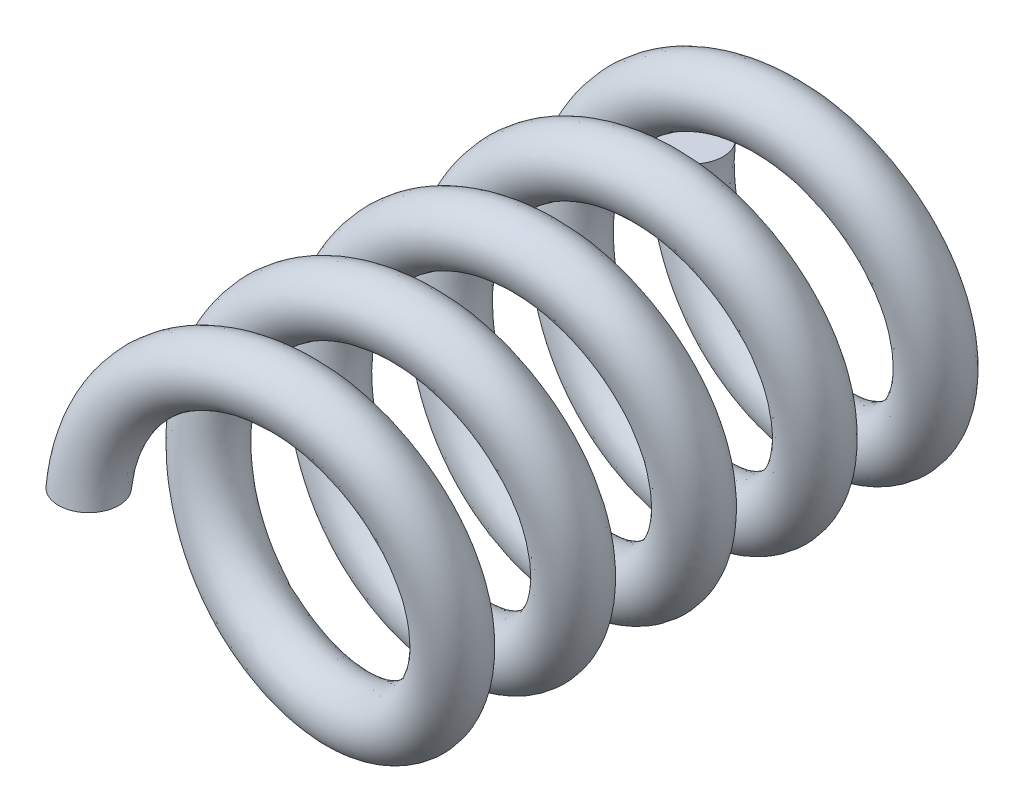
ISO-10303-21;
HEADER;
FILE_DESCRIPTION(('STEP AP214'),'2;1');
FILE_NAME('part.step','',(''),(''),'','','');
FILE_SCHEMA(('AUTOMOTIVE_DESIGN { 1 0 10303 214 1 1 1 1 }'));
ENDSEC;
DATA;
#1=APPLICATION_CONTEXT('core data for automotive mechanical design processes');
#2=APPLICATION_PROTOCOL_DEFINITION('international standard','automotive_design',2000,#1);
#3=PRODUCT_CONTEXT('',#1,'mechanical');
#4=PRODUCT('Part','Part','',(#3));
#5=PRODUCT_RELATED_PRODUCT_CATEGORY('part','',(#4));
#6=PRODUCT_DEFINITION_FORMATION('','',#4);
#7=PRODUCT_DEFINITION_CONTEXT('part definition',#1,'design');
#8=PRODUCT_DEFINITION('design','',#6,#7);
#9=PRODUCT_DEFINITION_SHAPE('','',#8);
#10=(LENGTH_UNIT() NAMED_UNIT(*) SI_UNIT(.MILLI.,.METRE.));
#11=(NAMED_UNIT(*) PLANE_ANGLE_UNIT() SI_UNIT($,.RADIAN.));
#12=(NAMED_UNIT(*) SI_UNIT($,.STERADIAN.) SOLID_ANGLE_UNIT());
#13=UNCERTAINTY_MEASURE_WITH_UNIT(LENGTH_MEASURE(1.E-05),#10,'distance_accuracy_value','');
#14=(GEOMETRIC_REPRESENTATION_CONTEXT(3) GLOBAL_UNCERTAINTY_ASSIGNED_CONTEXT((#13)) GLOBAL_UNIT_ASSIGNED_CONTEXT((#10,
#11,#12)) REPRESENTATION_CONTEXT('',''));
#15=CARTESIAN_POINT('',(0.,0.,0.));
#16=DIRECTION('',(0.,0.,1.));
#17=DIRECTION('',(1.,0.,0.));
#18=AXIS2_PLACEMENT_3D('',#15,#16,#17);
#19=CARTESIAN_POINT('',(0.,0.,0.));
#20=DIRECTION('',(0.,1.,0.));
#21=DIRECTION('',(0.,0.,1.));
#22=AXIS2_PLACEMENT_3D('',#19,#20,#21);
#23=PLANE('',#22);
#24=CARTESIAN_POINT('',(0.,0.,0.));
#25=DIRECTION('',(0.,1.,0.));
#26=DIRECTION('',(0.,0.,1.));
#27=AXIS2_PLACEMENT_3D('',#24,#25,#26);
#28=CIRCLE('',#27,0.254);
#29=CARTESIAN_POINT('',(0.,0.,0.254));
#30=VERTEX_POINT('',#29);
#31=EDGE_CURVE('E40',#30,#30,#28,.T.);
#32=ORIENTED_EDGE('',*,*,#31,.F.);
#33=EDGE_LOOP('',(#32));
#34=FACE_BOUND('',#33,.T.);
#35=ADVANCED_FACE('F33',(#34),#23,.F.);
#36=CARTESIAN_POINT('',(0.,1.02219465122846E-13,-5.08));
#37=DIRECTION('',(0.,1.,0.));
#38=DIRECTION('',(0.,0.,1.));
#39=AXIS2_PLACEMENT_3D('',#36,#37,#38);
#40=PLANE('',#39);
#41=CARTESIAN_POINT('',(0.,1.02219465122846E-13,-5.08));
#42=DIRECTION('',(0.,1.,0.));
#43=DIRECTION('',(0.,0.,1.));
#44=AXIS2_PLACEMENT_3D('',#41,#42,#43);
#45=CIRCLE('',#44,0.254);
#46=CARTESIAN_POINT('',(0.,1.02219465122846E-13,-4.826));
#47=VERTEX_POINT('',#46);
#48=EDGE_CURVE('E11',#47,#47,#45,.T.);
#49=ORIENTED_EDGE('',*,*,#48,.T.);
#50=EDGE_LOOP('',(#49));
#51=FACE_BOUND('',#50,.T.);
#52=ADVANCED_FACE('F47',(#51),#40,.T.);
#53=CARTESIAN_POINT('',(0.,0.,0.254));
#54=CARTESIAN_POINT('',(0.,0.733234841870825,0.169333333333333));
#55=CARTESIAN_POINT('',(0.635,1.09985226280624,0.084666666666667));
#56=CARTESIAN_POINT('',(1.27,1.46646968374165,0.));
#57=CARTESIAN_POINT('',(1.905,1.09985226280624,-0.0846666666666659));
#58=CARTESIAN_POINT('',(2.54,0.733234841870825,-0.169333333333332));
#59=CARTESIAN_POINT('',(2.54,0.,-0.253999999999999));
#60=CARTESIAN_POINT('',(2.54,-0.733234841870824,-0.338666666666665));
#61=CARTESIAN_POINT('',(1.905,-1.09985226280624,-0.423333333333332));
#62=CARTESIAN_POINT('',(1.27,-1.46646968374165,-0.507999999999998));
#63=CARTESIAN_POINT('',(0.635000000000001,-1.09985226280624,-0.592666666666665));
#64=CARTESIAN_POINT('',(0.,-0.733234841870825,-0.677333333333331));
#65=CARTESIAN_POINT('',(0.,0.,-0.761999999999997));
#66=CARTESIAN_POINT('',(0.,0.733234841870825,-0.846666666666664));
#67=CARTESIAN_POINT('',(0.635,1.09985226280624,-0.93133333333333));
#68=CARTESIAN_POINT('',(1.27,1.46646968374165,-1.016));
#69=CARTESIAN_POINT('',(1.905,1.09985226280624,-1.10066666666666));
#70=CARTESIAN_POINT('',(2.54,0.733234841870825,-1.18533333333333));
#71=CARTESIAN_POINT('',(2.54,0.,-1.27));
#72=CARTESIAN_POINT('',(2.54,-0.733234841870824,-1.35466666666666));
#73=CARTESIAN_POINT('',(1.905,-1.09985226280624,-1.43933333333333));
#74=CARTESIAN_POINT('',(1.27,-1.46646968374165,-1.524));
#75=CARTESIAN_POINT('',(0.635000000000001,-1.09985226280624,-1.60866666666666));
#76=CARTESIAN_POINT('',(0.,-0.733234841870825,-1.69333333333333));
#77=CARTESIAN_POINT('',(0.,0.,-1.77799999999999));
#78=CARTESIAN_POINT('',(0.,0.733234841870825,-1.86266666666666));
#79=CARTESIAN_POINT('',(0.635,1.09985226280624,-1.94733333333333));
#80=CARTESIAN_POINT('',(1.27,1.46646968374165,-2.03199999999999));
#81=CARTESIAN_POINT('',(1.905,1.09985226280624,-2.11666666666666));
#82=CARTESIAN_POINT('',(2.54,0.733234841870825,-2.20133333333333));
#83=CARTESIAN_POINT('',(2.54,0.,-2.28599999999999));
#84=CARTESIAN_POINT('',(2.54,-0.733234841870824,-2.37066666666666));
#85=CARTESIAN_POINT('',(1.905,-1.09985226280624,-2.45533333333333));
#86=CARTESIAN_POINT('',(1.27,-1.46646968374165,-2.53999999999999));
#87=CARTESIAN_POINT('',(0.635000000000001,-1.09985226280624,-2.62466666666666));
#88=CARTESIAN_POINT('',(0.,-0.733234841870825,-2.70933333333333));
#89=CARTESIAN_POINT('',(0.,0.,-2.79399999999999));
#90=CARTESIAN_POINT('',(0.,0.733234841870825,-2.87866666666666));
#91=CARTESIAN_POINT('',(0.635,1.09985226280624,-2.96333333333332));
#92=CARTESIAN_POINT('',(1.27,1.46646968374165,-3.04799999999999));
#93=CARTESIAN_POINT('',(1.905,1.09985226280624,-3.13266666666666));
#94=CARTESIAN_POINT('',(2.54,0.733234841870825,-3.21733333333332));
#95=CARTESIAN_POINT('',(2.54,0.,-3.30199999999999));
#96=CARTESIAN_POINT('',(2.54,-0.733234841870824,-3.38666666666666));
#97=CARTESIAN_POINT('',(1.905,-1.09985226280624,-3.47133333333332));
#98=CARTESIAN_POINT('',(1.27,-1.46646968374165,-3.55599999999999));
#99=CARTESIAN_POINT('',(0.635000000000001,-1.09985226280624,-3.64066666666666));
#100=CARTESIAN_POINT('',(0.,-0.733234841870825,-3.72533333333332));
#101=CARTESIAN_POINT('',(0.,0.,-3.80999999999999));
#102=CARTESIAN_POINT('',(0.,0.733234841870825,-3.89466666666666));
#103=CARTESIAN_POINT('',(0.635,1.09985226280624,-3.97933333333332));
#104=CARTESIAN_POINT('',(1.27,1.46646968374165,-4.06399999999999));
#105=CARTESIAN_POINT('',(1.905,1.09985226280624,-4.14866666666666));
#106=CARTESIAN_POINT('',(2.54,0.733234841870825,-4.23333333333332));
#107=CARTESIAN_POINT('',(2.54,0.,-4.31799999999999));
#108=CARTESIAN_POINT('',(2.54,-0.733234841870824,-4.40266666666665));
#109=CARTESIAN_POINT('',(1.905,-1.09985226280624,-4.48733333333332));
#110=CARTESIAN_POINT('',(1.27,-1.46646968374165,-4.57199999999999));
#111=CARTESIAN_POINT('',(0.635000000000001,-1.09985226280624,-4.65666666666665));
#112=CARTESIAN_POINT('',(0.,-0.733234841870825,-4.74133333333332));
#113=CARTESIAN_POINT('',(0.,0.,-4.82599999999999));
#114=CARTESIAN_POINT('',(0.508,0.,0.254));
#115=CARTESIAN_POINT('',(0.508,0.439940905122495,0.169333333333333));
#116=CARTESIAN_POINT('',(0.889,0.659911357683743,0.084666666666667));
#117=CARTESIAN_POINT('',(1.27,0.87988181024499,0.));
#118=CARTESIAN_POINT('',(1.651,0.659911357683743,-0.0846666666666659));
#119=CARTESIAN_POINT('',(2.032,0.439940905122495,-0.169333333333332));
#120=CARTESIAN_POINT('',(2.032,0.,-0.253999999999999));
#121=CARTESIAN_POINT('',(2.032,-0.439940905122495,-0.338666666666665));
#122=CARTESIAN_POINT('',(1.651,-0.659911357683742,-0.423333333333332));
#123=CARTESIAN_POINT('',(1.27,-0.87988181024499,-0.507999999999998));
#124=CARTESIAN_POINT('',(0.889,-0.659911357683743,-0.592666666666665));
#125=CARTESIAN_POINT('',(0.508,-0.439940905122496,-0.677333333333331));
#126=CARTESIAN_POINT('',(0.508,0.,-0.761999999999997));
#127=CARTESIAN_POINT('',(0.508,0.439940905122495,-0.846666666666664));
#128=CARTESIAN_POINT('',(0.889,0.659911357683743,-0.93133333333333));
#129=CARTESIAN_POINT('',(1.27,0.87988181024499,-1.016));
#130=CARTESIAN_POINT('',(1.651,0.659911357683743,-1.10066666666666));
#131=CARTESIAN_POINT('',(2.032,0.439940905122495,-1.18533333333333));
#132=CARTESIAN_POINT('',(2.032,0.,-1.27));
#133=CARTESIAN_POINT('',(2.032,-0.439940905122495,-1.35466666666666));
#134=CARTESIAN_POINT('',(1.651,-0.659911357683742,-1.43933333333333));
#135=CARTESIAN_POINT('',(1.27,-0.87988181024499,-1.524));
#136=CARTESIAN_POINT('',(0.889,-0.659911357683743,-1.60866666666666));
#137=CARTESIAN_POINT('',(0.508,-0.439940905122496,-1.69333333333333));
#138=CARTESIAN_POINT('',(0.508,0.,-1.778));
#139=CARTESIAN_POINT('',(0.508,0.439940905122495,-1.86266666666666));
#140=CARTESIAN_POINT('',(0.889,0.659911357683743,-1.94733333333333));
#141=CARTESIAN_POINT('',(1.27,0.87988181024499,-2.03199999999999));
#142=CARTESIAN_POINT('',(1.651,0.659911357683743,-2.11666666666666));
#143=CARTESIAN_POINT('',(2.032,0.439940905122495,-2.20133333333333));
#144=CARTESIAN_POINT('',(2.032,0.,-2.28599999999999));
#145=CARTESIAN_POINT('',(2.032,-0.439940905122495,-2.37066666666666));
#146=CARTESIAN_POINT('',(1.651,-0.659911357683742,-2.45533333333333));
#147=CARTESIAN_POINT('',(1.27,-0.87988181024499,-2.53999999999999));
#148=CARTESIAN_POINT('',(0.889,-0.659911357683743,-2.62466666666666));
#149=CARTESIAN_POINT('',(0.508,-0.439940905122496,-2.70933333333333));
#150=CARTESIAN_POINT('',(0.508,0.,-2.79399999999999));
#151=CARTESIAN_POINT('',(0.508,0.439940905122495,-2.87866666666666));
#152=CARTESIAN_POINT('',(0.889,0.659911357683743,-2.96333333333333));
#153=CARTESIAN_POINT('',(1.27,0.87988181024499,-3.04799999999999));
#154=CARTESIAN_POINT('',(1.651,0.659911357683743,-3.13266666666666));
#155=CARTESIAN_POINT('',(2.032,0.439940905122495,-3.21733333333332));
#156=CARTESIAN_POINT('',(2.032,0.,-3.30199999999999));
#157=CARTESIAN_POINT('',(2.032,-0.439940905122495,-3.38666666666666));
#158=CARTESIAN_POINT('',(1.651,-0.659911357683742,-3.47133333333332));
#159=CARTESIAN_POINT('',(1.27,-0.87988181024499,-3.55599999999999));
#160=CARTESIAN_POINT('',(0.889,-0.659911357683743,-3.64066666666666));
#161=CARTESIAN_POINT('',(0.508,-0.439940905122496,-3.72533333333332));
#162=CARTESIAN_POINT('',(0.508,0.,-3.80999999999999));
#163=CARTESIAN_POINT('',(0.508,0.439940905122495,-3.89466666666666));
#164=CARTESIAN_POINT('',(0.889,0.659911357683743,-3.97933333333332));
#165=CARTESIAN_POINT('',(1.27,0.87988181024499,-4.06399999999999));
#166=CARTESIAN_POINT('',(1.651,0.659911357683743,-4.14866666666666));
#167=CARTESIAN_POINT('',(2.032,0.439940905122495,-4.23333333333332));
#168=CARTESIAN_POINT('',(2.032,0.,-4.31799999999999));
#169=CARTESIAN_POINT('',(2.032,-0.439940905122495,-4.40266666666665));
#170=CARTESIAN_POINT('',(1.651,-0.659911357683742,-4.48733333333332));
#171=CARTESIAN_POINT('',(1.27,-0.87988181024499,-4.57199999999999));
#172=CARTESIAN_POINT('',(0.889,-0.659911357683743,-4.65666666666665));
#173=CARTESIAN_POINT('',(0.508,-0.439940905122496,-4.74133333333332));
#174=CARTESIAN_POINT('',(0.508,0.,-4.82599999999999));
#175=CARTESIAN_POINT('',(0.508,0.,-0.254));
#176=CARTESIAN_POINT('',(0.508,0.439940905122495,-0.338666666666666));
#177=CARTESIAN_POINT('',(0.889,0.659911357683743,-0.423333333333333));
#178=CARTESIAN_POINT('',(1.27,0.87988181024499,-0.507999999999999));
#179=CARTESIAN_POINT('',(1.651,0.659911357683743,-0.592666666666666));
#180=CARTESIAN_POINT('',(2.032,0.439940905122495,-0.677333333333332));
#181=CARTESIAN_POINT('',(2.032,0.,-0.761999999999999));
#182=CARTESIAN_POINT('',(2.032,-0.439940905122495,-0.846666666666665));
#183=CARTESIAN_POINT('',(1.651,-0.659911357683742,-0.931333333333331));
#184=CARTESIAN_POINT('',(1.27,-0.87988181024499,-1.016));
#185=CARTESIAN_POINT('',(0.889,-0.659911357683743,-1.10066666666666));
#186=CARTESIAN_POINT('',(0.508,-0.439940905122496,-1.18533333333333));
#187=CARTESIAN_POINT('',(0.508,0.,-1.27));
#188=CARTESIAN_POINT('',(0.508,0.439940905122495,-1.35466666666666));
#189=CARTESIAN_POINT('',(0.889,0.659911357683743,-1.43933333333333));
#190=CARTESIAN_POINT('',(1.27,0.87988181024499,-1.524));
#191=CARTESIAN_POINT('',(1.651,0.659911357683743,-1.60866666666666));
#192=CARTESIAN_POINT('',(2.032,0.439940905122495,-1.69333333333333));
#193=CARTESIAN_POINT('',(2.032,0.,-1.778));
#194=CARTESIAN_POINT('',(2.032,-0.439940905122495,-1.86266666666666));
#195=CARTESIAN_POINT('',(1.651,-0.659911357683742,-1.94733333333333));
#196=CARTESIAN_POINT('',(1.27,-0.87988181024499,-2.032));
#197=CARTESIAN_POINT('',(0.889,-0.659911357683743,-2.11666666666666));
#198=CARTESIAN_POINT('',(0.508,-0.439940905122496,-2.20133333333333));
#199=CARTESIAN_POINT('',(0.508,0.,-2.28599999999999));
#200=CARTESIAN_POINT('',(0.508,0.439940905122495,-2.37066666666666));
#201=CARTESIAN_POINT('',(0.889,0.659911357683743,-2.45533333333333));
#202=CARTESIAN_POINT('',(1.27,0.87988181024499,-2.53999999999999));
#203=CARTESIAN_POINT('',(1.651,0.659911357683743,-2.62466666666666));
#204=CARTESIAN_POINT('',(2.032,0.439940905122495,-2.70933333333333));
#205=CARTESIAN_POINT('',(2.032,0.,-2.79399999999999));
#206=CARTESIAN_POINT('',(2.032,-0.439940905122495,-2.87866666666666));
#207=CARTESIAN_POINT('',(1.651,-0.659911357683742,-2.96333333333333));
#208=CARTESIAN_POINT('',(1.27,-0.87988181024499,-3.04799999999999));
#209=CARTESIAN_POINT('',(0.889,-0.659911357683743,-3.13266666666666));
#210=CARTESIAN_POINT('',(0.508,-0.439940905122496,-3.21733333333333));
#211=CARTESIAN_POINT('',(0.508,0.,-3.30199999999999));
#212=CARTESIAN_POINT('',(0.508,0.439940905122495,-3.38666666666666));
#213=CARTESIAN_POINT('',(0.889,0.659911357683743,-3.47133333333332));
#214=CARTESIAN_POINT('',(1.27,0.87988181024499,-3.55599999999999));
#215=CARTESIAN_POINT('',(1.651,0.659911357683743,-3.64066666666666));
#216=CARTESIAN_POINT('',(2.032,0.439940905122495,-3.72533333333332));
#217=CARTESIAN_POINT('',(2.032,0.,-3.80999999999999));
#218=CARTESIAN_POINT('',(2.032,-0.439940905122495,-3.89466666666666));
#219=CARTESIAN_POINT('',(1.651,-0.659911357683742,-3.97933333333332));
#220=CARTESIAN_POINT('',(1.27,-0.87988181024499,-4.06399999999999));
#221=CARTESIAN_POINT('',(0.889,-0.659911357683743,-4.14866666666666));
#222=CARTESIAN_POINT('',(0.508,-0.439940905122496,-4.23333333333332));
#223=CARTESIAN_POINT('',(0.508,0.,-4.31799999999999));
#224=CARTESIAN_POINT('',(0.508,0.439940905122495,-4.40266666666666));
#225=CARTESIAN_POINT('',(0.889,0.659911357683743,-4.48733333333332));
#226=CARTESIAN_POINT('',(1.27,0.87988181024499,-4.57199999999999));
#227=CARTESIAN_POINT('',(1.651,0.659911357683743,-4.65666666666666));
#228=CARTESIAN_POINT('',(2.032,0.439940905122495,-4.74133333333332));
#229=CARTESIAN_POINT('',(2.032,0.,-4.82599999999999));
#230=CARTESIAN_POINT('',(2.032,-0.439940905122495,-4.91066666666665));
#231=CARTESIAN_POINT('',(1.651,-0.659911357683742,-4.99533333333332));
#232=CARTESIAN_POINT('',(1.27,-0.87988181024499,-5.07999999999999));
#233=CARTESIAN_POINT('',(0.889,-0.659911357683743,-5.16466666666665));
#234=CARTESIAN_POINT('',(0.508,-0.439940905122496,-5.24933333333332));
#235=CARTESIAN_POINT('',(0.508,0.,-5.33399999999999));
#236=CARTESIAN_POINT('',(0.,0.,-0.254));
#237=CARTESIAN_POINT('',(0.,0.733234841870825,-0.338666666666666));
#238=CARTESIAN_POINT('',(0.635,1.09985226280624,-0.423333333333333));
#239=CARTESIAN_POINT('',(1.27,1.46646968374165,-0.507999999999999));
#240=CARTESIAN_POINT('',(1.905,1.09985226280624,-0.592666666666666));
#241=CARTESIAN_POINT('',(2.54,0.733234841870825,-0.677333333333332));
#242=CARTESIAN_POINT('',(2.54,0.,-0.761999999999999));
#243=CARTESIAN_POINT('',(2.54,-0.733234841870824,-0.846666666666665));
#244=CARTESIAN_POINT('',(1.905,-1.09985226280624,-0.931333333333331));
#245=CARTESIAN_POINT('',(1.27,-1.46646968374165,-1.016));
#246=CARTESIAN_POINT('',(0.635000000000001,-1.09985226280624,-1.10066666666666));
#247=CARTESIAN_POINT('',(0.,-0.733234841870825,-1.18533333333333));
#248=CARTESIAN_POINT('',(0.,0.,-1.27));
#249=CARTESIAN_POINT('',(0.,0.733234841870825,-1.35466666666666));
#250=CARTESIAN_POINT('',(0.635,1.09985226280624,-1.43933333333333));
#251=CARTESIAN_POINT('',(1.27,1.46646968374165,-1.524));
#252=CARTESIAN_POINT('',(1.905,1.09985226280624,-1.60866666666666));
#253=CARTESIAN_POINT('',(2.54,0.733234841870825,-1.69333333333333));
#254=CARTESIAN_POINT('',(2.54,0.,-1.778));
#255=CARTESIAN_POINT('',(2.54,-0.733234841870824,-1.86266666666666));
#256=CARTESIAN_POINT('',(1.905,-1.09985226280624,-1.94733333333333));
#257=CARTESIAN_POINT('',(1.27,-1.46646968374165,-2.032));
#258=CARTESIAN_POINT('',(0.635000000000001,-1.09985226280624,-2.11666666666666));
#259=CARTESIAN_POINT('',(0.,-0.733234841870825,-2.20133333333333));
#260=CARTESIAN_POINT('',(0.,0.,-2.28599999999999));
#261=CARTESIAN_POINT('',(0.,0.733234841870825,-2.37066666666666));
#262=CARTESIAN_POINT('',(0.635,1.09985226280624,-2.45533333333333));
#263=CARTESIAN_POINT('',(1.27,1.46646968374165,-2.53999999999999));
#264=CARTESIAN_POINT('',(1.905,1.09985226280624,-2.62466666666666));
#265=CARTESIAN_POINT('',(2.54,0.733234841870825,-2.70933333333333));
#266=CARTESIAN_POINT('',(2.54,0.,-2.79399999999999));
#267=CARTESIAN_POINT('',(2.54,-0.733234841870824,-2.87866666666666));
#268=CARTESIAN_POINT('',(1.905,-1.09985226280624,-2.96333333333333));
#269=CARTESIAN_POINT('',(1.27,-1.46646968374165,-3.04799999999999));
#270=CARTESIAN_POINT('',(0.635000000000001,-1.09985226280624,-3.13266666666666));
#271=CARTESIAN_POINT('',(0.,-0.733234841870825,-3.21733333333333));
#272=CARTESIAN_POINT('',(0.,0.,-3.30199999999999));
#273=CARTESIAN_POINT('',(0.,0.733234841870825,-3.38666666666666));
#274=CARTESIAN_POINT('',(0.635,1.09985226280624,-3.47133333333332));
#275=CARTESIAN_POINT('',(1.27,1.46646968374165,-3.55599999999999));
#276=CARTESIAN_POINT('',(1.905,1.09985226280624,-3.64066666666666));
#277=CARTESIAN_POINT('',(2.54,0.733234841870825,-3.72533333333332));
#278=CARTESIAN_POINT('',(2.54,0.,-3.80999999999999));
#279=CARTESIAN_POINT('',(2.54,-0.733234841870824,-3.89466666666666));
#280=CARTESIAN_POINT('',(1.905,-1.09985226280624,-3.97933333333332));
#281=CARTESIAN_POINT('',(1.27,-1.46646968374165,-4.06399999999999));
#282=CARTESIAN_POINT('',(0.635000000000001,-1.09985226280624,-4.14866666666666));
#283=CARTESIAN_POINT('',(0.,-0.733234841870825,-4.23333333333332));
#284=CARTESIAN_POINT('',(0.,0.,-4.31799999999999));
#285=CARTESIAN_POINT('',(0.,0.733234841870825,-4.40266666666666));
#286=CARTESIAN_POINT('',(0.635,1.09985226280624,-4.48733333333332));
#287=CARTESIAN_POINT('',(1.27,1.46646968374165,-4.57199999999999));
#288=CARTESIAN_POINT('',(1.905,1.09985226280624,-4.65666666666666));
#289=CARTESIAN_POINT('',(2.54,0.733234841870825,-4.74133333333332));
#290=CARTESIAN_POINT('',(2.54,0.,-4.82599999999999));
#291=CARTESIAN_POINT('',(2.54,-0.733234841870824,-4.91066666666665));
#292=CARTESIAN_POINT('',(1.905,-1.09985226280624,-4.99533333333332));
#293=CARTESIAN_POINT('',(1.27,-1.46646968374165,-5.07999999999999));
#294=CARTESIAN_POINT('',(0.635000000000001,-1.09985226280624,-5.16466666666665));
#295=CARTESIAN_POINT('',(0.,-0.733234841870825,-5.24933333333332));
#296=CARTESIAN_POINT('',(0.,0.,-5.33399999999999));
#297=CARTESIAN_POINT('',(-0.508,0.,-0.254));
#298=CARTESIAN_POINT('',(-0.508,1.02652877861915,-0.338666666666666));
#299=CARTESIAN_POINT('',(0.381,1.53979316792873,-0.423333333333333));
#300=CARTESIAN_POINT('',(1.27,2.05305755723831,-0.507999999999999));
#301=CARTESIAN_POINT('',(2.159,1.53979316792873,-0.592666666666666));
#302=CARTESIAN_POINT('',(3.048,1.02652877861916,-0.677333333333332));
#303=CARTESIAN_POINT('',(3.048,0.,-0.761999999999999));
#304=CARTESIAN_POINT('',(3.048,-1.02652877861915,-0.846666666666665));
#305=CARTESIAN_POINT('',(2.159,-1.53979316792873,-0.931333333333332));
#306=CARTESIAN_POINT('',(1.27,-2.05305755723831,-1.016));
#307=CARTESIAN_POINT('',(0.381000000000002,-1.53979316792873,-1.10066666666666));
#308=CARTESIAN_POINT('',(-0.507999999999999,-1.02652877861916,-1.18533333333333));
#309=CARTESIAN_POINT('',(-0.508,0.,-1.27));
#310=CARTESIAN_POINT('',(-0.508,1.02652877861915,-1.35466666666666));
#311=CARTESIAN_POINT('',(0.381,1.53979316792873,-1.43933333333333));
#312=CARTESIAN_POINT('',(1.27,2.05305755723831,-1.524));
#313=CARTESIAN_POINT('',(2.159,1.53979316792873,-1.60866666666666));
#314=CARTESIAN_POINT('',(3.048,1.02652877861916,-1.69333333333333));
#315=CARTESIAN_POINT('',(3.048,0.,-1.778));
#316=CARTESIAN_POINT('',(3.048,-1.02652877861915,-1.86266666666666));
#317=CARTESIAN_POINT('',(2.159,-1.53979316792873,-1.94733333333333));
#318=CARTESIAN_POINT('',(1.27,-2.05305755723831,-2.032));
#319=CARTESIAN_POINT('',(0.381000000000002,-1.53979316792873,-2.11666666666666));
#320=CARTESIAN_POINT('',(-0.507999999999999,-1.02652877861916,-2.20133333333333));
#321=CARTESIAN_POINT('',(-0.508,0.,-2.28599999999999));
#322=CARTESIAN_POINT('',(-0.508,1.02652877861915,-2.37066666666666));
#323=CARTESIAN_POINT('',(0.381,1.53979316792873,-2.45533333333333));
#324=CARTESIAN_POINT('',(1.27,2.05305755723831,-2.53999999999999));
#325=CARTESIAN_POINT('',(2.159,1.53979316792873,-2.62466666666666));
#326=CARTESIAN_POINT('',(3.048,1.02652877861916,-2.70933333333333));
#327=CARTESIAN_POINT('',(3.048,0.,-2.79399999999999));
#328=CARTESIAN_POINT('',(3.048,-1.02652877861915,-2.87866666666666));
#329=CARTESIAN_POINT('',(2.159,-1.53979316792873,-2.96333333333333));
#330=CARTESIAN_POINT('',(1.27,-2.05305755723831,-3.04799999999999));
#331=CARTESIAN_POINT('',(0.381000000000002,-1.53979316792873,-3.13266666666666));
#332=CARTESIAN_POINT('',(-0.507999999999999,-1.02652877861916,-3.21733333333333));
#333=CARTESIAN_POINT('',(-0.508,0.,-3.30199999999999));
#334=CARTESIAN_POINT('',(-0.508,1.02652877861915,-3.38666666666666));
#335=CARTESIAN_POINT('',(0.381,1.53979316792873,-3.47133333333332));
#336=CARTESIAN_POINT('',(1.27,2.05305755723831,-3.55599999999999));
#337=CARTESIAN_POINT('',(2.159,1.53979316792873,-3.64066666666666));
#338=CARTESIAN_POINT('',(3.048,1.02652877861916,-3.72533333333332));
#339=CARTESIAN_POINT('',(3.048,0.,-3.80999999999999));
#340=CARTESIAN_POINT('',(3.048,-1.02652877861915,-3.89466666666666));
#341=CARTESIAN_POINT('',(2.159,-1.53979316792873,-3.97933333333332));
#342=CARTESIAN_POINT('',(1.27,-2.05305755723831,-4.06399999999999));
#343=CARTESIAN_POINT('',(0.381000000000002,-1.53979316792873,-4.14866666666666));
#344=CARTESIAN_POINT('',(-0.507999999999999,-1.02652877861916,-4.23333333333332));
#345=CARTESIAN_POINT('',(-0.508,0.,-4.31799999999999));
#346=CARTESIAN_POINT('',(-0.508,1.02652877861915,-4.40266666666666));
#347=CARTESIAN_POINT('',(0.381,1.53979316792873,-4.48733333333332));
#348=CARTESIAN_POINT('',(1.27,2.05305755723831,-4.57199999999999));
#349=CARTESIAN_POINT('',(2.159,1.53979316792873,-4.65666666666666));
#350=CARTESIAN_POINT('',(3.048,1.02652877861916,-4.74133333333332));
#351=CARTESIAN_POINT('',(3.048,0.,-4.82599999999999));
#352=CARTESIAN_POINT('',(3.048,-1.02652877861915,-4.91066666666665));
#353=CARTESIAN_POINT('',(2.159,-1.53979316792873,-4.99533333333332));
#354=CARTESIAN_POINT('',(1.27,-2.05305755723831,-5.07999999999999));
#355=CARTESIAN_POINT('',(0.381000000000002,-1.53979316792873,-5.16466666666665));
#356=CARTESIAN_POINT('',(-0.507999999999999,-1.02652877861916,-5.24933333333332));
#357=CARTESIAN_POINT('',(-0.508,0.,-5.33399999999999));
#358=CARTESIAN_POINT('',(-0.508,0.,0.254));
#359=CARTESIAN_POINT('',(-0.508,1.02652877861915,0.169333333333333));
#360=CARTESIAN_POINT('',(0.381,1.53979316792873,0.084666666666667));
#361=CARTESIAN_POINT('',(1.27,2.05305755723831,0.));
#362=CARTESIAN_POINT('',(2.159,1.53979316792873,-0.0846666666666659));
#363=CARTESIAN_POINT('',(3.048,1.02652877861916,-0.169333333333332));
#364=CARTESIAN_POINT('',(3.048,0.,-0.253999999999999));
#365=CARTESIAN_POINT('',(3.048,-1.02652877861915,-0.338666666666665));
#366=CARTESIAN_POINT('',(2.159,-1.53979316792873,-0.423333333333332));
#367=CARTESIAN_POINT('',(1.27,-2.05305755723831,-0.507999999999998));
#368=CARTESIAN_POINT('',(0.381000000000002,-1.53979316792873,-0.592666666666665));
#369=CARTESIAN_POINT('',(-0.507999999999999,-1.02652877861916,-0.677333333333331));
#370=CARTESIAN_POINT('',(-0.508,0.,-0.761999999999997));
#371=CARTESIAN_POINT('',(-0.508,1.02652877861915,-0.846666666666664));
#372=CARTESIAN_POINT('',(0.381,1.53979316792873,-0.93133333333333));
#373=CARTESIAN_POINT('',(1.27,2.05305755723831,-1.016));
#374=CARTESIAN_POINT('',(2.159,1.53979316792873,-1.10066666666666));
#375=CARTESIAN_POINT('',(3.048,1.02652877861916,-1.18533333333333));
#376=CARTESIAN_POINT('',(3.048,0.,-1.27));
#377=CARTESIAN_POINT('',(3.048,-1.02652877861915,-1.35466666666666));
#378=CARTESIAN_POINT('',(2.159,-1.53979316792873,-1.43933333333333));
#379=CARTESIAN_POINT('',(1.27,-2.05305755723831,-1.524));
#380=CARTESIAN_POINT('',(0.381000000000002,-1.53979316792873,-1.60866666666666));
#381=CARTESIAN_POINT('',(-0.507999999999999,-1.02652877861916,-1.69333333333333));
#382=CARTESIAN_POINT('',(-0.508,0.,-1.778));
#383=CARTESIAN_POINT('',(-0.508,1.02652877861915,-1.86266666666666));
#384=CARTESIAN_POINT('',(0.381,1.53979316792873,-1.94733333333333));
#385=CARTESIAN_POINT('',(1.27,2.05305755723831,-2.03199999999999));
#386=CARTESIAN_POINT('',(2.159,1.53979316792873,-2.11666666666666));
#387=CARTESIAN_POINT('',(3.048,1.02652877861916,-2.20133333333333));
#388=CARTESIAN_POINT('',(3.048,0.,-2.28599999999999));
#389=CARTESIAN_POINT('',(3.048,-1.02652877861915,-2.37066666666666));
#390=CARTESIAN_POINT('',(2.159,-1.53979316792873,-2.45533333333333));
#391=CARTESIAN_POINT('',(1.27,-2.05305755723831,-2.53999999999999));
#392=CARTESIAN_POINT('',(0.381000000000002,-1.53979316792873,-2.62466666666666));
#393=CARTESIAN_POINT('',(-0.507999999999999,-1.02652877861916,-2.70933333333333));
#394=CARTESIAN_POINT('',(-0.508,0.,-2.79399999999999));
#395=CARTESIAN_POINT('',(-0.508,1.02652877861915,-2.87866666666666));
#396=CARTESIAN_POINT('',(0.381,1.53979316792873,-2.96333333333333));
#397=CARTESIAN_POINT('',(1.27,2.05305755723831,-3.04799999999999));
#398=CARTESIAN_POINT('',(2.159,1.53979316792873,-3.13266666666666));
#399=CARTESIAN_POINT('',(3.048,1.02652877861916,-3.21733333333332));
#400=CARTESIAN_POINT('',(3.048,0.,-3.30199999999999));
#401=CARTESIAN_POINT('',(3.048,-1.02652877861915,-3.38666666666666));
#402=CARTESIAN_POINT('',(2.159,-1.53979316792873,-3.47133333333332));
#403=CARTESIAN_POINT('',(1.27,-2.05305755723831,-3.55599999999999));
#404=CARTESIAN_POINT('',(0.381000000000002,-1.53979316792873,-3.64066666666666));
#405=CARTESIAN_POINT('',(-0.507999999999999,-1.02652877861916,-3.72533333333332));
#406=CARTESIAN_POINT('',(-0.508,0.,-3.80999999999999));
#407=CARTESIAN_POINT('',(-0.508,1.02652877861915,-3.89466666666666));
#408=CARTESIAN_POINT('',(0.381,1.53979316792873,-3.97933333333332));
#409=CARTESIAN_POINT('',(1.27,2.05305755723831,-4.06399999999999));
#410=CARTESIAN_POINT('',(2.159,1.53979316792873,-4.14866666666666));
#411=CARTESIAN_POINT('',(3.048,1.02652877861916,-4.23333333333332));
#412=CARTESIAN_POINT('',(3.048,0.,-4.31799999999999));
#413=CARTESIAN_POINT('',(3.048,-1.02652877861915,-4.40266666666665));
#414=CARTESIAN_POINT('',(2.159,-1.53979316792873,-4.48733333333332));
#415=CARTESIAN_POINT('',(1.27,-2.05305755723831,-4.57199999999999));
#416=CARTESIAN_POINT('',(0.381000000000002,-1.53979316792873,-4.65666666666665));
#417=CARTESIAN_POINT('',(-0.507999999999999,-1.02652877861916,-4.74133333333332));
#418=CARTESIAN_POINT('',(-0.508,0.,-4.82599999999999));
#419=CARTESIAN_POINT('',(0.,0.,0.254));
#420=CARTESIAN_POINT('',(0.,0.733234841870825,0.169333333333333));
#421=CARTESIAN_POINT('',(0.635,1.09985226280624,0.084666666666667));
#422=CARTESIAN_POINT('',(1.27,1.46646968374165,0.));
#423=CARTESIAN_POINT('',(1.905,1.09985226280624,-0.0846666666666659));
#424=CARTESIAN_POINT('',(2.54,0.733234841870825,-0.169333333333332));
#425=CARTESIAN_POINT('',(2.54,0.,-0.253999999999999));
#426=CARTESIAN_POINT('',(2.54,-0.733234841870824,-0.338666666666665));
#427=CARTESIAN_POINT('',(1.905,-1.09985226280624,-0.423333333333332));
#428=CARTESIAN_POINT('',(1.27,-1.46646968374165,-0.507999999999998));
#429=CARTESIAN_POINT('',(0.635000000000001,-1.09985226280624,-0.592666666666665));
#430=CARTESIAN_POINT('',(0.,-0.733234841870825,-0.677333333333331));
#431=CARTESIAN_POINT('',(0.,0.,-0.761999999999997));
#432=CARTESIAN_POINT('',(0.,0.733234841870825,-0.846666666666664));
#433=CARTESIAN_POINT('',(0.635,1.09985226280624,-0.93133333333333));
#434=CARTESIAN_POINT('',(1.27,1.46646968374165,-1.016));
#435=CARTESIAN_POINT('',(1.905,1.09985226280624,-1.10066666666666));
#436=CARTESIAN_POINT('',(2.54,0.733234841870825,-1.18533333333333));
#437=CARTESIAN_POINT('',(2.54,0.,-1.27));
#438=CARTESIAN_POINT('',(2.54,-0.733234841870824,-1.35466666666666));
#439=CARTESIAN_POINT('',(1.905,-1.09985226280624,-1.43933333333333));
#440=CARTESIAN_POINT('',(1.27,-1.46646968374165,-1.524));
#441=CARTESIAN_POINT('',(0.635000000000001,-1.09985226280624,-1.60866666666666));
#442=CARTESIAN_POINT('',(0.,-0.733234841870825,-1.69333333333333));
#443=CARTESIAN_POINT('',(0.,0.,-1.77799999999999));
#444=CARTESIAN_POINT('',(0.,0.733234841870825,-1.86266666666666));
#445=CARTESIAN_POINT('',(0.635,1.09985226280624,-1.94733333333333));
#446=CARTESIAN_POINT('',(1.27,1.46646968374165,-2.03199999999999));
#447=CARTESIAN_POINT('',(1.905,1.09985226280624,-2.11666666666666));
#448=CARTESIAN_POINT('',(2.54,0.733234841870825,-2.20133333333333));
#449=CARTESIAN_POINT('',(2.54,0.,-2.28599999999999));
#450=CARTESIAN_POINT('',(2.54,-0.733234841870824,-2.37066666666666));
#451=CARTESIAN_POINT('',(1.905,-1.09985226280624,-2.45533333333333));
#452=CARTESIAN_POINT('',(1.27,-1.46646968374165,-2.53999999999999));
#453=CARTESIAN_POINT('',(0.635000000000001,-1.09985226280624,-2.62466666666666));
#454=CARTESIAN_POINT('',(0.,-0.733234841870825,-2.70933333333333));
#455=CARTESIAN_POINT('',(0.,0.,-2.79399999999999));
#456=CARTESIAN_POINT('',(0.,0.733234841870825,-2.87866666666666));
#457=CARTESIAN_POINT('',(0.635,1.09985226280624,-2.96333333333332));
#458=CARTESIAN_POINT('',(1.27,1.46646968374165,-3.04799999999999));
#459=CARTESIAN_POINT('',(1.905,1.09985226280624,-3.13266666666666));
#460=CARTESIAN_POINT('',(2.54,0.733234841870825,-3.21733333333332));
#461=CARTESIAN_POINT('',(2.54,0.,-3.30199999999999));
#462=CARTESIAN_POINT('',(2.54,-0.733234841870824,-3.38666666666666));
#463=CARTESIAN_POINT('',(1.905,-1.09985226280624,-3.47133333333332));
#464=CARTESIAN_POINT('',(1.27,-1.46646968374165,-3.55599999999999));
#465=CARTESIAN_POINT('',(0.635000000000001,-1.09985226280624,-3.64066666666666));
#466=CARTESIAN_POINT('',(0.,-0.733234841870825,-3.72533333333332));
#467=CARTESIAN_POINT('',(0.,0.,-3.80999999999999));
#468=CARTESIAN_POINT('',(0.,0.733234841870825,-3.89466666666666));
#469=CARTESIAN_POINT('',(0.635,1.09985226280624,-3.97933333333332));
#470=CARTESIAN_POINT('',(1.27,1.46646968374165,-4.06399999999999));
#471=CARTESIAN_POINT('',(1.905,1.09985226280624,-4.14866666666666));
#472=CARTESIAN_POINT('',(2.54,0.733234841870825,-4.23333333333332));
#473=CARTESIAN_POINT('',(2.54,0.,-4.31799999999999));
#474=CARTESIAN_POINT('',(2.54,-0.733234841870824,-4.40266666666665));
#475=CARTESIAN_POINT('',(1.905,-1.09985226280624,-4.48733333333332));
#476=CARTESIAN_POINT('',(1.27,-1.46646968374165,-4.57199999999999));
#477=CARTESIAN_POINT('',(0.635000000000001,-1.09985226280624,-4.65666666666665));
#478=CARTESIAN_POINT('',(0.,-0.733234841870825,-4.74133333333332));
#479=CARTESIAN_POINT('',(0.,0.,-4.82599999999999));
#480=(BOUNDED_SURFACE() B_SPLINE_SURFACE(3,2,((#53,#54,#55,#56,#57,#58,#59,#60,#61,#62,#63,#64,
#65,#66,#67,#68,#69,#70,#71,#72,#73,#74,#75,#76,#77,#78,#79,#80,#81,#82,#83,#84,#85,#86,#87,#88,
#89,#90,#91,#92,#93,#94,#95,#96,#97,#98,#99,#100,#101,#102,#103,#104,#105,#106,#107,#108,#109,
#110,#111,#112,#113),(#114,#115,#116,#117,#118,#119,#120,#121,#122,#123,#124,#125,#126,#127,
#128,#129,#130,#131,#132,#133,#134,#135,#136,#137,#138,#139,#140,#141,#142,#143,#144,#145,#146,
#147,#148,#149,#150,#151,#152,#153,#154,#155,#156,#157,#158,#159,#160,#161,#162,#163,#164,#165,
#166,#167,#168,#169,#170,#171,#172,#173,#174),(#175,#176,#177,#178,#179,#180,#181,#182,#183,
#184,#185,#186,#187,#188,#189,#190,#191,#192,#193,#194,#195,#196,#197,#198,#199,#200,#201,#202,
#203,#204,#205,#206,#207,#208,#209,#210,#211,#212,#213,#214,#215,#216,#217,#218,#219,#220,#221,
#222,#223,#224,#225,#226,#227,#228,#229,#230,#231,#232,#233,#234,#235),(#236,#237,#238,#239,
#240,#241,#242,#243,#244,#245,#246,#247,#248,#249,#250,#251,#252,#253,#254,#255,#256,#257,#258,
#259,#260,#261,#262,#263,#264,#265,#266,#267,#268,#269,#270,#271,#272,#273,#274,#275,#276,#277,
#278,#279,#280,#281,#282,#283,#284,#285,#286,#287,#288,#289,#290,#291,#292,#293,#294,#295,#296),
(#297,#298,#299,#300,#301,#302,#303,#304,#305,#306,#307,#308,#309,#310,#311,#312,#313,#314,#315,
#316,#317,#318,#319,#320,#321,#322,#323,#324,#325,#326,#327,#328,#329,#330,#331,#332,#333,#334,
#335,#336,#337,#338,#339,#340,#341,#342,#343,#344,#345,#346,#347,#348,#349,#350,#351,#352,#353,
#354,#355,#356,#357),(#358,#359,#360,#361,#362,#363,#364,#365,#366,#367,#368,#369,#370,#371,
#372,#373,#374,#375,#376,#377,#378,#379,#380,#381,#382,#383,#384,#385,#386,#387,#388,#389,#390,
#391,#392,#393,#394,#395,#396,#397,#398,#399,#400,#401,#402,#403,#404,#405,#406,#407,#408,#409,
#410,#411,#412,#413,#414,#415,#416,#417,#418),(#419,#420,#421,#422,#423,#424,#425,#426,#427,
#428,#429,#430,#431,#432,#433,#434,#435,#436,#437,#438,#439,#440,#441,#442,#443,#444,#445,#446,
#447,#448,#449,#450,#451,#452,#453,#454,#455,#456,#457,#458,#459,#460,#461,#462,#463,#464,#465,
#466,#467,#468,#469,#470,#471,#472,#473,#474,#475,#476,#477,#478,#479)),.UNSPECIFIED.,.T.,.F.,
.F.) B_SPLINE_SURFACE_WITH_KNOTS((4,3,4),(3,2,2,2,2,2,2,2,2,2,2,2,2,2,2,2,2,2,2,2,2,2,2,2,2,2,2,
2,2,2,3),(0.,0.5,1.),(0.,0.0333333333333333,0.0666666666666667,0.1,0.133333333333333,
0.166666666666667,0.2,0.233333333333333,0.266666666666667,0.3,0.333333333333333,
0.366666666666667,0.4,0.433333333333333,0.466666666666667,0.5,0.533333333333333,
0.566666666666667,0.6,0.633333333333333,0.666666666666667,0.7,0.733333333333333,
0.766666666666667,0.8,0.833333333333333,0.866666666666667,0.9,0.933333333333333,
0.966666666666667,1.),
.UNSPECIFIED.) GEOMETRIC_REPRESENTATION_ITEM() RATIONAL_B_SPLINE_SURFACE(((1.,0.866025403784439,
1.,0.866025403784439,1.,0.866025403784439,1.,0.866025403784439,1.,0.866025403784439,1.,
0.866025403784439,1.,0.866025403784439,1.,0.866025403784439,1.,0.866025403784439,1.,
0.866025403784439,1.,0.866025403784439,1.,0.866025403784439,1.,0.866025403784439,1.,
0.866025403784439,1.,0.866025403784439,1.,0.866025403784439,1.,0.866025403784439,1.,
0.866025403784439,1.,0.866025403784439,1.,0.866025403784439,1.,0.866025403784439,1.,
0.866025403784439,1.,0.866025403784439,1.,0.866025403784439,1.,0.866025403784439,1.,
0.866025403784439,1.,0.866025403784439,1.,0.866025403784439,1.,0.866025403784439,1.,
0.866025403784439,1.),(0.333333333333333,0.288675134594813,0.333333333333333,0.288675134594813,
0.333333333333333,0.288675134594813,0.333333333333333,0.288675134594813,0.333333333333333,
0.288675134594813,0.333333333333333,0.288675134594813,0.333333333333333,0.288675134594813,
0.333333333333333,0.288675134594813,0.333333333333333,0.288675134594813,0.333333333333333,
0.288675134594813,0.333333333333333,0.288675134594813,0.333333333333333,0.288675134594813,
0.333333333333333,0.288675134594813,0.333333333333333,0.288675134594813,0.333333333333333,
0.288675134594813,0.333333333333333,0.288675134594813,0.333333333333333,0.288675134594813,
0.333333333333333,0.288675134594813,0.333333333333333,0.288675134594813,0.333333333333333,
0.288675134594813,0.333333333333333,0.288675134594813,0.333333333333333,0.288675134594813,
0.333333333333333,0.288675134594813,0.333333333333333,0.288675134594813,0.333333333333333,
0.288675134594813,0.333333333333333,0.288675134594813,0.333333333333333,0.288675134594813,
0.333333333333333,0.288675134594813,0.333333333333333,0.288675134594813,0.333333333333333,
0.288675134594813,0.333333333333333),(0.333333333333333,0.288675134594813,0.333333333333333,
0.288675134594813,0.333333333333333,0.288675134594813,0.333333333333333,0.288675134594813,
0.333333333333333,0.288675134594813,0.333333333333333,0.288675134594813,0.333333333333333,
0.288675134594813,0.333333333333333,0.288675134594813,0.333333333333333,0.288675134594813,
0.333333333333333,0.288675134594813,0.333333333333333,0.288675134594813,0.333333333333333,
0.288675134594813,0.333333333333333,0.288675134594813,0.333333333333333,0.288675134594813,
0.333333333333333,0.288675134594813,0.333333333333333,0.288675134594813,0.333333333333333,
0.288675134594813,0.333333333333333,0.288675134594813,0.333333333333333,0.288675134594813,
0.333333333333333,0.288675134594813,0.333333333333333,0.288675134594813,0.333333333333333,
0.288675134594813,0.333333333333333,0.288675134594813,0.333333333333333,0.288675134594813,
0.333333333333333,0.288675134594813,0.333333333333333,0.288675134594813,0.333333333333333,
0.288675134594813,0.333333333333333,0.288675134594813,0.333333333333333,0.288675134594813,
0.333333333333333,0.288675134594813,0.333333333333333),(1.,0.866025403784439,1.,
0.866025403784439,1.,0.866025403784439,1.,0.866025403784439,1.,0.866025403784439,1.,
0.866025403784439,1.,0.866025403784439,1.,0.866025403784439,1.,0.866025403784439,1.,
0.866025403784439,1.,0.866025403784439,1.,0.866025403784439,1.,0.866025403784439,1.,
0.866025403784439,1.,0.866025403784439,1.,0.866025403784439,1.,0.866025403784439,1.,
0.866025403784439,1.,0.866025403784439,1.,0.866025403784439,1.,0.866025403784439,1.,
0.866025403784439,1.,0.866025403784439,1.,0.866025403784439,1.,0.866025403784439,1.,
0.866025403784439,1.,0.866025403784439,1.,0.866025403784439,1.,0.866025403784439,1.,
0.866025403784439,1.),(0.333333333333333,0.288675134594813,0.333333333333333,0.288675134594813,
0.333333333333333,0.288675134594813,0.333333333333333,0.288675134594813,0.333333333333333,
0.288675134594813,0.333333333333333,0.288675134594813,0.333333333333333,0.288675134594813,
0.333333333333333,0.288675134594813,0.333333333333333,0.288675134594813,0.333333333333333,
0.288675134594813,0.333333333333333,0.288675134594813,0.333333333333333,0.288675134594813,
0.333333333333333,0.288675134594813,0.333333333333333,0.288675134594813,0.333333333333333,
0.288675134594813,0.333333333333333,0.288675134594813,0.333333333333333,0.288675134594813,
0.333333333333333,0.288675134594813,0.333333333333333,0.288675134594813,0.333333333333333,
0.288675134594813,0.333333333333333,0.288675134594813,0.333333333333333,0.288675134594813,
0.333333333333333,0.288675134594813,0.333333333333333,0.288675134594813,0.333333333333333,
0.288675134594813,0.333333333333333,0.288675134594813,0.333333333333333,0.288675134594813,
0.333333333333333,0.288675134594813,0.333333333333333,0.288675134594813,0.333333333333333,
0.288675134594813,0.333333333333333),(0.333333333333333,0.288675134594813,0.333333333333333,
0.288675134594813,0.333333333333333,0.288675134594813,0.333333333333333,0.288675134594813,
0.333333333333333,0.288675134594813,0.333333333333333,0.288675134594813,0.333333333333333,
0.288675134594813,0.333333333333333,0.288675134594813,0.333333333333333,0.288675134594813,
0.333333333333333,0.288675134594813,0.333333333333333,0.288675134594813,0.333333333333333,
0.288675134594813,0.333333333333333,0.288675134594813,0.333333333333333,0.288675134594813,
0.333333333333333,0.288675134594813,0.333333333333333,0.288675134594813,0.333333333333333,
0.288675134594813,0.333333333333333,0.288675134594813,0.333333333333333,0.288675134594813,
0.333333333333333,0.288675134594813,0.333333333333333,0.288675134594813,0.333333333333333,
0.288675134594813,0.333333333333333,0.288675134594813,0.333333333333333,0.288675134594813,
0.333333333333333,0.288675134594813,0.333333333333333,0.288675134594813,0.333333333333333,
0.288675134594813,0.333333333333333,0.288675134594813,0.333333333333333,0.288675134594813,
0.333333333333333,0.288675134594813,0.333333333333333),(1.,0.866025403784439,1.,
0.866025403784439,1.,0.866025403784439,1.,0.866025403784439,1.,0.866025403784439,1.,
0.866025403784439,1.,0.866025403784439,1.,0.866025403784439,1.,0.866025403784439,1.,
0.866025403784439,1.,0.866025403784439,1.,0.866025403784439,1.,0.866025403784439,1.,
0.866025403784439,1.,0.866025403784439,1.,0.866025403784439,1.,0.866025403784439,1.,
0.866025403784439,1.,0.866025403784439,1.,0.866025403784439,1.,0.866025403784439,1.,
0.866025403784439,1.,0.866025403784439,1.,0.866025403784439,1.,0.866025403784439,1.,
0.866025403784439,1.,0.866025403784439,1.,0.866025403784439,1.,0.866025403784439,1.,
0.866025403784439,1.))) REPRESENTATION_ITEM('') SURFACE());
#481=ORIENTED_EDGE('',*,*,#48,.F.);
#482=EDGE_LOOP('',(#481));
#483=FACE_BOUND('',#482,.T.);
#484=ORIENTED_EDGE('',*,*,#31,.T.);
#485=EDGE_LOOP('',(#484));
#486=FACE_BOUND('',#485,.T.);
#487=ADVANCED_FACE('F49',(#483,#486),#480,.T.);
#488=CLOSED_SHELL('',(#35,#52,#487));
#489=MANIFOLD_SOLID_BREP('B2',#488);
#490=ADVANCED_BREP_SHAPE_REPRESENTATION('',(#18,#489),#14);
#491=SHAPE_DEFINITION_REPRESENTATION(#9,#490);
ENDSEC;
END-ISO-10303-21;
